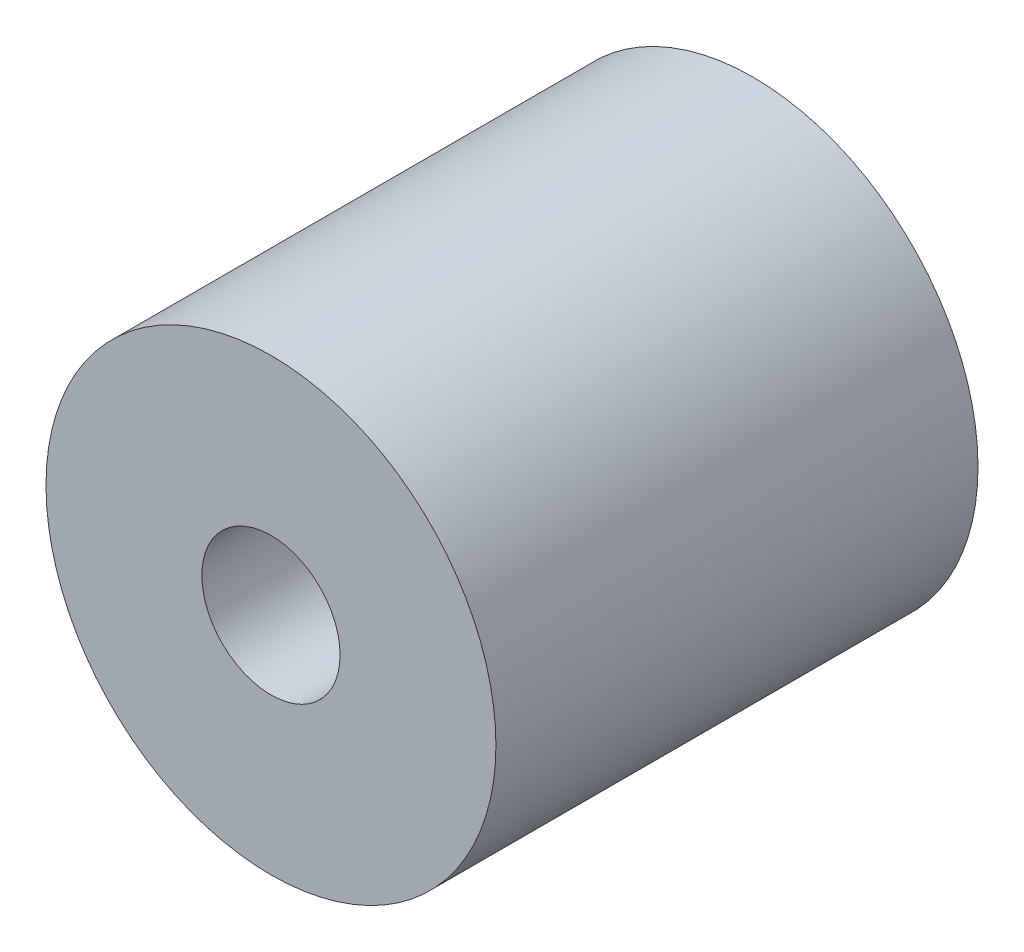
from build123d import *

# Parameters (mm, degrees)
ESQUISSE1_R        = 14
ESQUISSE1_R_2      = 4.3
BOSS_EXTRU_1_DEPTH = 30


with BuildPart() as part:
    # Esquisse1 → Boss.-Extru.1 (new body)
    with BuildSketch(Plane.XY):
        with Locations((76, 143)):
            Circle(ESQUISSE1_R)
        with Locations((76, 143)):
            Circle(ESQUISSE1_R_2, mode=Mode.SUBTRACT)
    extrude(amount=BOSS_EXTRU_1_DEPTH)


solid = part.part
